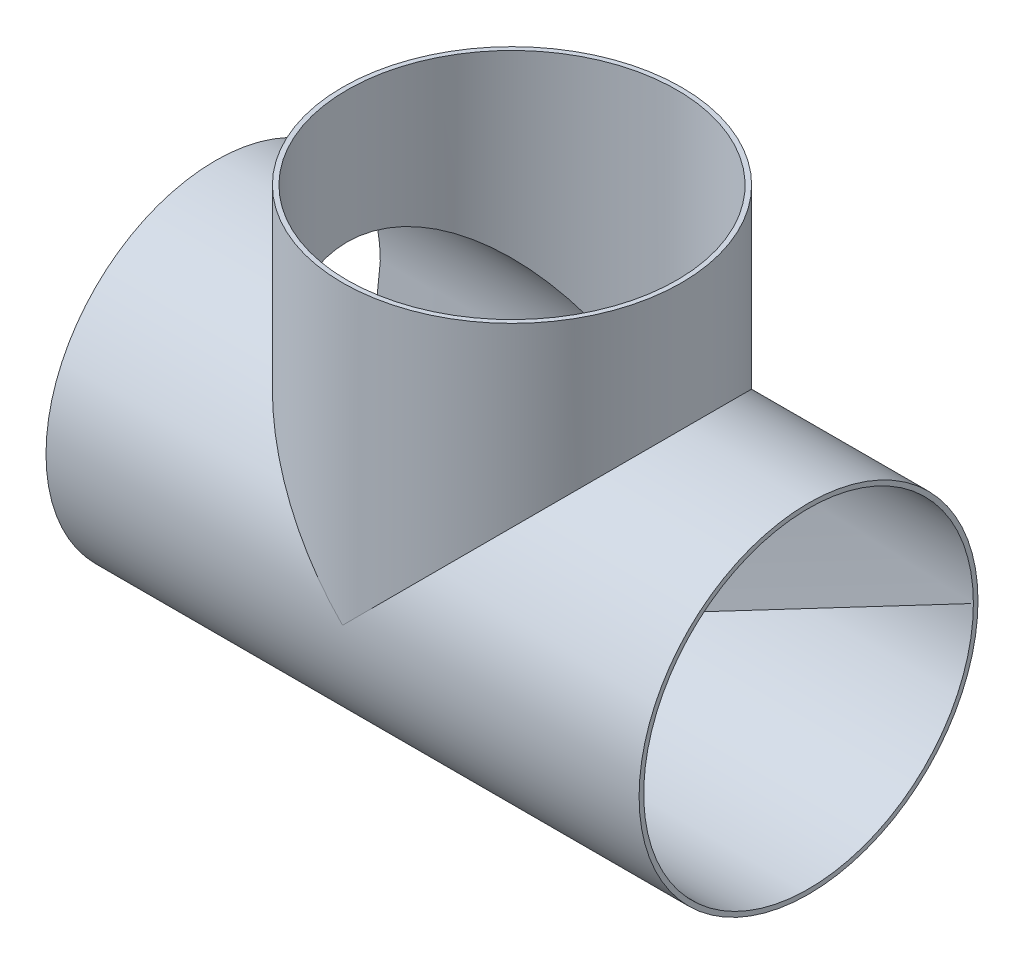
from build123d import *

# Parameters (mm, degrees)
SKETCH1_R           = 101.6
BOSS_EXTRUDE1_DEPTH = 177.8
SKETCH2_R           = 101.6
BOSS_EXTRUDE2_DEPTH = 177.8
SKETCH3_R           = 98.8314
CUT_EXTRUDE1_DEPTH  = 177.8
SKETCH4_R           = 98.8314
CUT_EXTRUDE2_DEPTH  = 177.8


with BuildPart() as part:
    # Sketch1 → Boss-Extrude1 (new, symmetric)
    with BuildSketch(Plane(origin=(0, 0, 0), x_dir=(0, 0, -1), z_dir=(1, 0, 0))):
        Circle(SKETCH1_R)
    extrude(amount=BOSS_EXTRUDE1_DEPTH, both=True)

    # Sketch2 → Boss-Extrude2 (add)
    with BuildSketch(Plane(origin=(0, 0, 0), x_dir=(1, 0, 0), z_dir=(0, 1, 0))):
        with Locations(Location((0, 0, 0), (0, 0, 270))):
            Circle(SKETCH2_R)
    extrude(amount=BOSS_EXTRUDE2_DEPTH)

    # Sketch3 → Cut-Extrude1 (cut)
    with BuildSketch(Plane(origin=(0, 0, 0), x_dir=(1, 0, 0), z_dir=(0, 1, 0))):
        with Locations(Location((0, 0, 0), (0, 0, 270))):
            Circle(SKETCH3_R)
    extrude(amount=CUT_EXTRUDE1_DEPTH, mode=Mode.SUBTRACT)

    # Sketch4 → Cut-Extrude2 (cut, symmetric)
    with BuildSketch(Plane(origin=(0, 0, 0), x_dir=(0, 0, -1), z_dir=(1, 0, 0))):
        Circle(SKETCH4_R)
    extrude(amount=CUT_EXTRUDE2_DEPTH, both=True, mode=Mode.SUBTRACT)


solid = part.part
